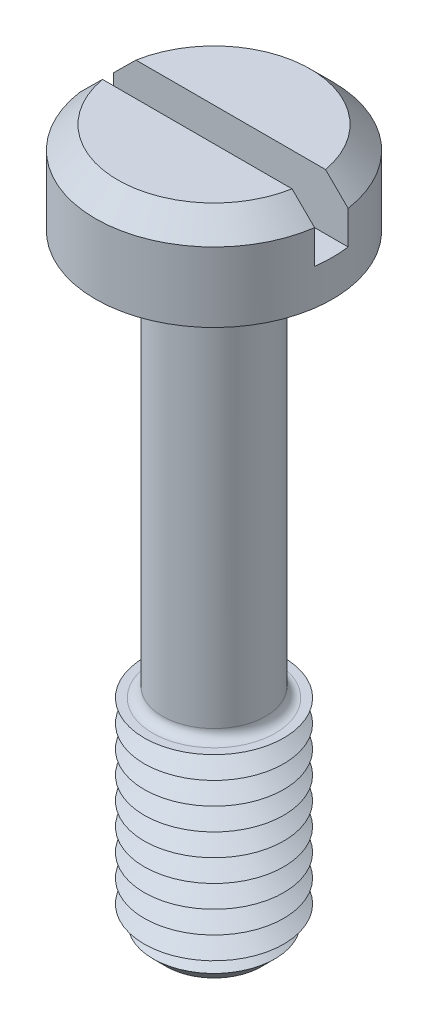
ISO-10303-21;
HEADER;
FILE_DESCRIPTION(('STEP AP214'),'2;1');
FILE_NAME('part.step','',(''),(''),'','','');
FILE_SCHEMA(('AUTOMOTIVE_DESIGN { 1 0 10303 214 1 1 1 1 }'));
ENDSEC;
DATA;
#1=APPLICATION_CONTEXT('core data for automotive mechanical design processes');
#2=APPLICATION_PROTOCOL_DEFINITION('international standard','automotive_design',2000,#1);
#3=PRODUCT_CONTEXT('',#1,'mechanical');
#4=PRODUCT('Part','Part','',(#3));
#5=PRODUCT_RELATED_PRODUCT_CATEGORY('part','',(#4));
#6=PRODUCT_DEFINITION_FORMATION('','',#4);
#7=PRODUCT_DEFINITION_CONTEXT('part definition',#1,'design');
#8=PRODUCT_DEFINITION('design','',#6,#7);
#9=PRODUCT_DEFINITION_SHAPE('','',#8);
#10=(LENGTH_UNIT() NAMED_UNIT(*) SI_UNIT(.MILLI.,.METRE.));
#11=(NAMED_UNIT(*) PLANE_ANGLE_UNIT() SI_UNIT($,.RADIAN.));
#12=(NAMED_UNIT(*) SI_UNIT($,.STERADIAN.) SOLID_ANGLE_UNIT());
#13=UNCERTAINTY_MEASURE_WITH_UNIT(LENGTH_MEASURE(1.E-05),#10,'distance_accuracy_value','');
#14=(GEOMETRIC_REPRESENTATION_CONTEXT(3) GLOBAL_UNCERTAINTY_ASSIGNED_CONTEXT((#13)) GLOBAL_UNIT_ASSIGNED_CONTEXT((#10,
#11,#12)) REPRESENTATION_CONTEXT('',''));
#15=CARTESIAN_POINT('',(0.,0.,0.));
#16=DIRECTION('',(0.,0.,1.));
#17=DIRECTION('',(1.,0.,0.));
#18=AXIS2_PLACEMENT_3D('',#15,#16,#17);
#19=CARTESIAN_POINT('',(0.,3.3,0.));
#20=DIRECTION('',(0.,1.,0.));
#21=DIRECTION('',(0.,0.,1.));
#22=AXIS2_PLACEMENT_3D('',#19,#20,#21);
#23=PLANE('',#22);
#24=DIRECTION('',(-1.,0.,0.));
#25=VECTOR('',#24,1.);
#26=CARTESIAN_POINT('',(4.25,3.3,-0.6));
#27=LINE('',#26,#25);
#28=CARTESIAN_POINT('',(3.39742549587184,3.3,-0.6));
#29=VERTEX_POINT('',#28);
#30=CARTESIAN_POINT('',(-3.39742549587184,3.3,-0.6));
#31=VERTEX_POINT('',#30);
#32=EDGE_CURVE('E110',#29,#31,#27,.T.);
#33=ORIENTED_EDGE('',*,*,#32,.F.);
#34=CARTESIAN_POINT('',(0.,3.3,0.));
#35=DIRECTION('',(0.,1.,0.));
#36=DIRECTION('',(0.,0.,1.));
#37=AXIS2_PLACEMENT_3D('',#34,#35,#36);
#38=CIRCLE('',#37,3.45);
#39=EDGE_CURVE('E113',#29,#31,#38,.T.);
#40=ORIENTED_EDGE('',*,*,#39,.T.);
#41=EDGE_LOOP('',(#33,#40));
#42=FACE_BOUND('',#41,.T.);
#43=ADVANCED_FACE('F39',(#42),#23,.T.);
#44=CARTESIAN_POINT('',(0.,3.3,0.));
#45=DIRECTION('',(0.,-1.,0.));
#46=DIRECTION('',(0.,0.,-1.));
#47=AXIS2_PLACEMENT_3D('',#44,#45,#46);
#48=CONICAL_SURFACE('',#47,3.45,0.785398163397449);
#49=CARTESIAN_POINT('',(9.35351408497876,-2.62273843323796,-0.6));
#50=CARTESIAN_POINT('',(9.03263557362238,-2.30252317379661,-0.6));
#51=CARTESIAN_POINT('',(8.7117281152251,-1.98233690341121,-0.6));
#52=CARTESIAN_POINT('',(8.069812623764,-1.34205341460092,-0.6));
#53=CARTESIAN_POINT('',(7.74880458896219,-1.02195619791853,-0.6));
#54=CARTESIAN_POINT('',(7.10652460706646,-0.381761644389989,-0.6));
#55=CARTESIAN_POINT('',(6.78525260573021,-0.0616643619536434,-0.6));
#56=CARTESIAN_POINT('',(6.14251393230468,0.578323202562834,-0.6));
#57=CARTESIAN_POINT('',(5.82104726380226,0.898213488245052,-0.6));
#58=CARTESIAN_POINT('',(5.17196209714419,1.5434750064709,-0.6));
#59=CARTESIAN_POINT('',(4.84433778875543,1.86884039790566,-0.6));
#60=CARTESIAN_POINT('',(4.35244442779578,2.35644593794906,-0.6));
#61=CARTESIAN_POINT('',(4.18839924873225,2.51891187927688,-0.6));
#62=CARTESIAN_POINT('',(3.86009606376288,2.84362679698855,-0.6));
#63=CARTESIAN_POINT('',(3.69583805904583,3.0058757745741,-0.6));
#64=CARTESIAN_POINT('',(3.36705354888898,3.33001661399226,-0.6));
#65=CARTESIAN_POINT('',(3.20252712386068,3.49190855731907,-0.6));
#66=CARTESIAN_POINT('',(2.87298689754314,3.81520272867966,-0.6));
#67=CARTESIAN_POINT('',(2.70797308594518,3.97660494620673,-0.6));
#68=CARTESIAN_POINT('',(2.37716903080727,4.29858210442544,-0.6));
#69=CARTESIAN_POINT('',(2.2113788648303,4.45915712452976,-0.6));
#70=CARTESIAN_POINT('',(1.96157219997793,4.69884609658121,-0.6));
#71=CARTESIAN_POINT('',(1.87811785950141,4.77854546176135,-0.6));
#72=CARTESIAN_POINT('',(1.71066064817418,4.93736532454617,-0.6));
#73=CARTESIAN_POINT('',(1.62665778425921,5.01648582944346,-0.6));
#74=CARTESIAN_POINT('',(1.49655488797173,5.13773269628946,-0.6));
#75=CARTESIAN_POINT('',(1.45074972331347,5.1801752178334,-0.6));
#76=CARTESIAN_POINT('',(1.35882119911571,5.26471614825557,-0.6));
#77=CARTESIAN_POINT('',(1.31269783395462,5.30681455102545,-0.6));
#78=CARTESIAN_POINT('',(1.22008852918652,5.39050695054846,-0.6));
#79=CARTESIAN_POINT('',(1.17360305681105,5.43210146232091,-0.6));
#80=CARTESIAN_POINT('',(1.08007401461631,5.51465347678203,-0.6));
#81=CARTESIAN_POINT('',(1.03303046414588,5.55561100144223,-0.6));
#82=CARTESIAN_POINT('',(0.919047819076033,5.65299331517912,-0.6));
#83=CARTESIAN_POINT('',(0.851738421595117,5.70899242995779,-0.6));
#84=CARTESIAN_POINT('',(0.748806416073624,5.79068526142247,-0.6));
#85=CARTESIAN_POINT('',(0.714125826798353,5.81756213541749,-0.6));
#86=CARTESIAN_POINT('',(0.643915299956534,5.8701807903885,-0.6));
#87=CARTESIAN_POINT('',(0.608385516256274,5.89592277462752,-0.6));
#88=CARTESIAN_POINT('',(0.545162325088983,5.93955652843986,-0.6));
#89=CARTESIAN_POINT('',(0.517718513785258,5.95780799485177,-0.6));
#90=CARTESIAN_POINT('',(0.462025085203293,5.99303174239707,-0.6));
#91=CARTESIAN_POINT('',(0.433775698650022,6.01000438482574,-0.6));
#92=CARTESIAN_POINT('',(0.376341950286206,6.04213837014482,-0.6));
#93=CARTESIAN_POINT('',(0.34716009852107,6.05730412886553,-0.6));
#94=CARTESIAN_POINT('',(0.2876425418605,6.08513394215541,-0.6));
#95=CARTESIAN_POINT('',(0.257308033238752,6.09780051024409,-0.6));
#96=CARTESIAN_POINT('',(0.190863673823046,6.12124627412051,-0.6));
#97=CARTESIAN_POINT('',(0.154554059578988,6.1314857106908,-0.6));
#98=CARTESIAN_POINT('',(0.0807909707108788,6.1456540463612,-0.6));
#99=CARTESIAN_POINT('',(0.0433423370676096,6.14960664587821,-0.6));
#100=CARTESIAN_POINT('',(-0.0317987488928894,6.15033783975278,-0.6));
#101=CARTESIAN_POINT('',(-0.0694915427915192,6.1470842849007,-0.6));
#102=CARTESIAN_POINT('',(-0.143790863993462,6.13410921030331,-0.6));
#103=CARTESIAN_POINT('',(-0.180393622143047,6.12436747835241,-0.6));
#104=CARTESIAN_POINT('',(-0.254098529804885,6.09939647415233,-0.6));
#105=CARTESIAN_POINT('',(-0.291094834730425,6.0838685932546,-0.6));
#106=CARTESIAN_POINT('',(-0.363408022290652,6.0492466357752,-0.6));
#107=CARTESIAN_POINT('',(-0.398721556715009,6.03014579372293,-0.6));
#108=CARTESIAN_POINT('',(-0.468234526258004,5.98944452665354,-0.6));
#109=CARTESIAN_POINT('',(-0.50242270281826,5.96782521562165,-0.6));
#110=CARTESIAN_POINT('',(-0.569689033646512,5.92300618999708,-0.6));
#111=CARTESIAN_POINT('',(-0.602768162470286,5.89980792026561,-0.6));
#112=CARTESIAN_POINT('',(-0.671148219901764,5.85008963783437,-0.6));
#113=CARTESIAN_POINT('',(-0.706369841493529,5.82346130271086,-0.6));
#114=CARTESIAN_POINT('',(-0.776087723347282,5.76926828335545,-0.6));
#115=CARTESIAN_POINT('',(-0.810583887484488,5.74170347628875,-0.6));
#116=CARTESIAN_POINT('',(-0.913286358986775,5.6579827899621,-0.6));
#117=CARTESIAN_POINT('',(-0.980673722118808,5.60082541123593,-0.6));
#118=CARTESIAN_POINT('',(-1.11424616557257,5.48490670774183,-0.6));
#119=CARTESIAN_POINT('',(-1.18042891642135,5.42614273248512,-0.6));
#120=CARTESIAN_POINT('',(-1.31191262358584,5.30767463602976,-0.6));
#121=CARTESIAN_POINT('',(-1.37721382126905,5.24797078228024,-0.6));
#122=CARTESIAN_POINT('',(-1.50701089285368,5.12812906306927,-0.6));
#123=CARTESIAN_POINT('',(-1.57150872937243,5.06799331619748,-0.6));
#124=CARTESIAN_POINT('',(-1.70009132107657,4.94727328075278,-0.6));
#125=CARTESIAN_POINT('',(-1.76417604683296,4.88668896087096,-0.6));
#126=CARTESIAN_POINT('',(-1.95584105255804,4.7045882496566,-0.6));
#127=CARTESIAN_POINT('',(-2.08296922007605,4.58259645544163,-0.6));
#128=CARTESIAN_POINT('',(-2.33599178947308,4.33840625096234,-0.6));
#129=CARTESIAN_POINT('',(-2.46188913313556,4.21621087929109,-0.6));
#130=CARTESIAN_POINT('',(-2.71323511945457,3.9713592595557,-0.6));
#131=CARTESIAN_POINT('',(-2.83868376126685,3.84870301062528,-0.6));
#132=CARTESIAN_POINT('',(-3.21459106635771,3.48027743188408,-0.6));
#133=CARTESIAN_POINT('',(-3.46460626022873,3.23405597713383,-0.6));
#134=CARTESIAN_POINT('',(-3.96413793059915,2.74090313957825,-0.6));
#135=CARTESIAN_POINT('',(-4.21365415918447,2.49397150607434,-0.6));
#136=CARTESIAN_POINT('',(-4.71232475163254,1.99974737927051,-0.6));
#137=CARTESIAN_POINT('',(-4.96147911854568,1.75245488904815,-0.6));
#138=CARTESIAN_POINT('',(-5.45958725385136,1.25761544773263,-0.6));
#139=CARTESIAN_POINT('',(-5.70854099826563,1.01006847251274,-0.6));
#140=CARTESIAN_POINT('',(-6.20629498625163,0.514819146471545,-0.6));
#141=CARTESIAN_POINT('',(-6.45509522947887,0.267116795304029,-0.6));
#142=CARTESIAN_POINT('',(-7.2012856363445,-0.47610004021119,-0.6));
#143=CARTESIAN_POINT('',(-7.6985162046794,-0.971774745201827,-0.6));
#144=CARTESIAN_POINT('',(-8.38865115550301,-1.66007026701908,-0.6));
#145=CARTESIAN_POINT('',(-8.58165346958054,-1.85259293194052,-0.6));
#146=CARTESIAN_POINT('',(-8.8711273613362,-2.14139225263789,-0.6));
#147=CARTESIAN_POINT('',(-8.96761014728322,-2.23765767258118,-0.6));
#148=CARTESIAN_POINT('',(-9.16056764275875,-2.43019387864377,-0.6));
#149=CARTESIAN_POINT('',(-9.25704235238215,-2.52646466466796,-0.6));
#150=CARTESIAN_POINT('',(-9.35351408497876,-2.62273843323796,-0.6));
#151=B_SPLINE_CURVE_WITH_KNOTS('',3,(#49,#50,#51,#52,#53,#54,#55,#56,#57,#58,#59,#60,#61,#62,
#63,#64,#65,#66,#67,#68,#69,#70,#71,#72,#73,#74,#75,#76,#77,#78,#79,#80,#81,#82,#83,#84,#85,#86,
#87,#88,#89,#90,#91,#92,#93,#94,#95,#96,#97,#98,#99,#100,#101,#102,#103,#104,#105,#106,#107,
#108,#109,#110,#111,#112,#113,#114,#115,#116,#117,#118,#119,#120,#121,#122,#123,#124,#125,#126,
#127,#128,#129,#130,#131,#132,#133,#134,#135,#136,#137,#138,#139,#140,#141,#142,#143,#144,#145,
#146,#147,#148,#149,#150),.UNSPECIFIED.,.F.,.F.,(4,2,2,2,2,2,2,2,2,2,2,2,2,2,2,2,2,2,2,2,2,2,2,
2,2,2,2,2,2,2,2,2,2,2,2,2,2,2,2,2,2,2,2,2,2,2,2,2,2,2,4),(0.,1.35996600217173,2.71995696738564,
4.08050889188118,5.44103646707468,6.82624457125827,7.51888721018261,8.21152599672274,
8.90398568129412,9.59646011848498,10.288866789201,10.6350581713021,10.9812451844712,
11.1685812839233,11.3559207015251,11.5430489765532,11.7301707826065,11.9927784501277,
12.1243921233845,12.2559821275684,12.3548333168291,12.4536564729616,12.5522329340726,
12.6507097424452,12.763461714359,12.8757876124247,12.9886156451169,13.101796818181,
13.2218851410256,13.3422031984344,13.4634899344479,13.584667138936,13.7171086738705,
13.8495676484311,14.1146090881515,14.3801178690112,14.6455524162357,14.910099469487,
15.17466516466,15.7032346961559,16.2295761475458,16.755918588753,17.808623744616,
18.8617626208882,19.9148925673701,20.9681337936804,22.0213773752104,24.1276499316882,
24.9454725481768,25.3543534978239,25.7632286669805),.UNSPECIFIED.);
#152=CARTESIAN_POINT('',(4.20743389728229,2.5,-0.6));
#153=VERTEX_POINT('',#152);
#154=EDGE_CURVE('E268',#153,#29,#151,.T.);
#155=ORIENTED_EDGE('',*,*,#154,.F.);
#156=CARTESIAN_POINT('',(0.,2.5,0.));
#157=DIRECTION('',(0.,1.,0.));
#158=DIRECTION('',(0.,0.,1.));
#159=AXIS2_PLACEMENT_3D('',#156,#157,#158);
#160=CIRCLE('',#159,4.25);
#161=CARTESIAN_POINT('',(-4.20743389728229,2.5,-0.6));
#162=VERTEX_POINT('',#161);
#163=EDGE_CURVE('E128',#162,#153,#160,.F.);
#164=ORIENTED_EDGE('',*,*,#163,.F.);
#165=EDGE_CURVE('E102',#31,#162,#151,.T.);
#166=ORIENTED_EDGE('',*,*,#165,.F.);
#167=ORIENTED_EDGE('',*,*,#39,.F.);
#168=EDGE_LOOP('',(#155,#164,#166,#167));
#169=FACE_BOUND('',#168,.T.);
#170=ADVANCED_FACE('F230',(#169),#48,.T.);
#171=CARTESIAN_POINT('',(0.,-22.,0.));
#172=DIRECTION('',(0.,1.,0.));
#173=DIRECTION('',(0.,0.,1.));
#174=AXIS2_PLACEMENT_3D('',#171,#172,#173);
#175=CYLINDRICAL_SURFACE('',#174,1.85);
#176=CARTESIAN_POINT('',(0.,-14.15,0.));
#177=DIRECTION('',(0.,-1.,0.));
#178=DIRECTION('',(0.,0.,-1.));
#179=AXIS2_PLACEMENT_3D('',#176,#177,#178);
#180=CIRCLE('',#179,1.85);
#181=CARTESIAN_POINT('',(0.,-14.15,-1.85));
#182=VERTEX_POINT('',#181);
#183=EDGE_CURVE('E123',#182,#182,#180,.F.);
#184=ORIENTED_EDGE('',*,*,#183,.T.);
#185=EDGE_LOOP('',(#184));
#186=FACE_BOUND('',#185,.T.);
#187=CARTESIAN_POINT('',(0.,-0.35,0.));
#188=DIRECTION('',(0.,1.,0.));
#189=DIRECTION('',(0.,0.,1.));
#190=AXIS2_PLACEMENT_3D('',#187,#188,#189);
#191=CIRCLE('',#190,1.85);
#192=CARTESIAN_POINT('',(0.,-0.35,1.85));
#193=VERTEX_POINT('',#192);
#194=EDGE_CURVE('E384',#193,#193,#191,.F.);
#195=ORIENTED_EDGE('',*,*,#194,.T.);
#196=EDGE_LOOP('',(#195));
#197=FACE_BOUND('',#196,.T.);
#198=ADVANCED_FACE('F226',(#186,#197),#175,.T.);
#199=CARTESIAN_POINT('',(0.,3.3,0.));
#200=DIRECTION('',(0.,-1.,0.));
#201=DIRECTION('',(0.,0.,-1.));
#202=AXIS2_PLACEMENT_3D('',#199,#200,#201);
#203=CYLINDRICAL_SURFACE('',#202,4.25);
#204=ORIENTED_EDGE('',*,*,#163,.T.);
#205=DIRECTION('',(0.,-1.,0.));
#206=VECTOR('',#205,1.);
#207=CARTESIAN_POINT('',(4.20743389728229,3.3,-0.6));
#208=LINE('',#207,#206);
#209=CARTESIAN_POINT('',(4.20743389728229,1.3,-0.6));
#210=VERTEX_POINT('',#209);
#211=EDGE_CURVE('E64',#153,#210,#208,.T.);
#212=ORIENTED_EDGE('',*,*,#211,.T.);
#213=CARTESIAN_POINT('',(0.,1.3,0.));
#214=DIRECTION('',(0.,1.,0.));
#215=DIRECTION('',(0.,0.,1.));
#216=AXIS2_PLACEMENT_3D('',#213,#214,#215);
#217=CIRCLE('',#216,4.25);
#218=CARTESIAN_POINT('',(4.20743389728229,1.3,0.6));
#219=VERTEX_POINT('',#218);
#220=EDGE_CURVE('E11',#219,#210,#217,.T.);
#221=ORIENTED_EDGE('',*,*,#220,.F.);
#222=DIRECTION('',(0.,-1.,0.));
#223=VECTOR('',#222,1.);
#224=CARTESIAN_POINT('',(4.20743389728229,3.3,0.6));
#225=LINE('',#224,#223);
#226=CARTESIAN_POINT('',(4.20743389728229,2.5,0.6));
#227=VERTEX_POINT('',#226);
#228=EDGE_CURVE('E287',#219,#227,#225,.F.);
#229=ORIENTED_EDGE('',*,*,#228,.T.);
#230=CARTESIAN_POINT('',(-4.20743389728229,2.5,0.6));
#231=VERTEX_POINT('',#230);
#232=EDGE_CURVE('E120',#227,#231,#160,.F.);
#233=ORIENTED_EDGE('',*,*,#232,.T.);
#234=DIRECTION('',(0.,-1.,0.));
#235=VECTOR('',#234,1.);
#236=CARTESIAN_POINT('',(-4.20743389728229,3.3,0.6));
#237=LINE('',#236,#235);
#238=CARTESIAN_POINT('',(-4.20743389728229,1.3,0.6));
#239=VERTEX_POINT('',#238);
#240=EDGE_CURVE('E96',#231,#239,#237,.T.);
#241=ORIENTED_EDGE('',*,*,#240,.T.);
#242=CARTESIAN_POINT('',(-4.20743389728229,1.3,-0.6));
#243=VERTEX_POINT('',#242);
#244=EDGE_CURVE('E44',#243,#239,#217,.T.);
#245=ORIENTED_EDGE('',*,*,#244,.F.);
#246=DIRECTION('',(0.,-1.,0.));
#247=VECTOR('',#246,1.);
#248=CARTESIAN_POINT('',(-4.20743389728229,3.3,-0.6));
#249=LINE('',#248,#247);
#250=EDGE_CURVE('E292',#243,#162,#249,.F.);
#251=ORIENTED_EDGE('',*,*,#250,.T.);
#252=EDGE_LOOP('',(#204,#212,#221,#229,#233,#241,#245,#251));
#253=FACE_BOUND('',#252,.T.);
#254=CARTESIAN_POINT('',(0.,0.,0.));
#255=DIRECTION('',(0.,1.,0.));
#256=DIRECTION('',(0.,0.,1.));
#257=AXIS2_PLACEMENT_3D('',#254,#255,#256);
#258=CIRCLE('',#257,4.25);
#259=CARTESIAN_POINT('',(0.,0.,4.25));
#260=VERTEX_POINT('',#259);
#261=EDGE_CURVE('E371',#260,#260,#258,.T.);
#262=ORIENTED_EDGE('',*,*,#261,.T.);
#263=EDGE_LOOP('',(#262));
#264=FACE_BOUND('',#263,.T.);
#265=ADVANCED_FACE('F229',(#253,#264),#203,.T.);
#266=DIRECTION('',(1.,0.,0.));
#267=VECTOR('',#266,1.);
#268=CARTESIAN_POINT('',(4.25,3.3,0.6));
#269=LINE('',#268,#267);
#270=CARTESIAN_POINT('',(-3.39742549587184,3.3,0.6));
#271=VERTEX_POINT('',#270);
#272=CARTESIAN_POINT('',(3.39742549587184,3.3,0.6));
#273=VERTEX_POINT('',#272);
#274=EDGE_CURVE('E56',#271,#273,#269,.T.);
#275=ORIENTED_EDGE('',*,*,#274,.F.);
#276=EDGE_CURVE('E108',#271,#273,#38,.T.);
#277=ORIENTED_EDGE('',*,*,#276,.T.);
#278=EDGE_LOOP('',(#275,#277));
#279=FACE_BOUND('',#278,.T.);
#280=ADVANCED_FACE('F107',(#279),#23,.T.);
#281=CARTESIAN_POINT('',(0.,0.,0.));
#282=DIRECTION('',(0.,1.,0.));
#283=DIRECTION('',(0.,0.,1.));
#284=AXIS2_PLACEMENT_3D('',#281,#282,#283);
#285=PLANE('',#284);
#286=CARTESIAN_POINT('',(0.,0.,0.));
#287=DIRECTION('',(0.,1.,0.));
#288=DIRECTION('',(0.,0.,1.));
#289=AXIS2_PLACEMENT_3D('',#286,#287,#288);
#290=CIRCLE('',#289,2.2);
#291=CARTESIAN_POINT('',(0.,0.,2.2));
#292=VERTEX_POINT('',#291);
#293=EDGE_CURVE('E114',#292,#292,#290,.T.);
#294=ORIENTED_EDGE('',*,*,#293,.T.);
#295=EDGE_LOOP('',(#294));
#296=FACE_BOUND('',#295,.T.);
#297=ORIENTED_EDGE('',*,*,#261,.F.);
#298=EDGE_LOOP('',(#297));
#299=FACE_BOUND('',#298,.T.);
#300=ADVANCED_FACE('F220',(#296,#299),#285,.F.);
#301=CARTESIAN_POINT('',(0.,-14.5,0.));
#302=DIRECTION('',(0.,-1.,0.));
#303=DIRECTION('',(0.,0.,-1.));
#304=AXIS2_PLACEMENT_3D('',#301,#302,#303);
#305=PLANE('',#304);
#306=CARTESIAN_POINT('',(0.,-14.5,0.));
#307=DIRECTION('',(0.,-1.,0.));
#308=DIRECTION('',(0.,0.,-1.));
#309=AXIS2_PLACEMENT_3D('',#306,#307,#308);
#310=CIRCLE('',#309,2.2);
#311=CARTESIAN_POINT('',(0.,-14.5,-2.2));
#312=VERTEX_POINT('',#311);
#313=EDGE_CURVE('E378',#312,#312,#310,.T.);
#314=ORIENTED_EDGE('',*,*,#313,.T.);
#315=EDGE_LOOP('',(#314));
#316=FACE_BOUND('',#315,.T.);
#317=CARTESIAN_POINT('',(0.,-14.5,0.));
#318=DIRECTION('',(0.,1.,0.));
#319=DIRECTION('',(0.,0.,1.));
#320=AXIS2_PLACEMENT_3D('',#317,#318,#319);
#321=CIRCLE('',#320,2.5);
#322=CARTESIAN_POINT('',(0.,-14.5,2.5));
#323=VERTEX_POINT('',#322);
#324=EDGE_CURVE('E367',#323,#323,#321,.T.);
#325=ORIENTED_EDGE('',*,*,#324,.T.);
#326=EDGE_LOOP('',(#325));
#327=FACE_BOUND('',#326,.T.);
#328=ADVANCED_FACE('F216',(#316,#327),#305,.F.);
#329=CARTESIAN_POINT('',(0.,-14.9,0.));
#330=DIRECTION('',(0.,1.,0.));
#331=DIRECTION('',(0.,0.,1.));
#332=AXIS2_PLACEMENT_3D('',#329,#330,#331);
#333=CONICAL_SURFACE('',#332,1.80717967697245,1.0471975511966);
#334=ORIENTED_EDGE('',*,*,#324,.F.);
#335=EDGE_LOOP('',(#334));
#336=FACE_BOUND('',#335,.T.);
#337=CARTESIAN_POINT('',(0.,-14.9,0.));
#338=DIRECTION('',(0.,1.,0.));
#339=DIRECTION('',(0.,0.,1.));
#340=AXIS2_PLACEMENT_3D('',#337,#338,#339);
#341=CIRCLE('',#340,1.80717967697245);
#342=CARTESIAN_POINT('',(0.,-14.9,1.80717967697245));
#343=VERTEX_POINT('',#342);
#344=EDGE_CURVE('E363',#343,#343,#341,.T.);
#345=ORIENTED_EDGE('',*,*,#344,.T.);
#346=EDGE_LOOP('',(#345));
#347=FACE_BOUND('',#346,.T.);
#348=ADVANCED_FACE('F212',(#336,#347),#333,.T.);
#349=CARTESIAN_POINT('',(0.,-15.3,0.));
#350=DIRECTION('',(0.,-1.,0.));
#351=DIRECTION('',(0.,0.,-1.));
#352=AXIS2_PLACEMENT_3D('',#349,#350,#351);
#353=CONICAL_SURFACE('',#352,2.5,1.0471975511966);
#354=ORIENTED_EDGE('',*,*,#344,.F.);
#355=EDGE_LOOP('',(#354));
#356=FACE_BOUND('',#355,.T.);
#357=CARTESIAN_POINT('',(0.,-15.3,0.));
#358=DIRECTION('',(0.,1.,0.));
#359=DIRECTION('',(0.,0.,1.));
#360=AXIS2_PLACEMENT_3D('',#357,#358,#359);
#361=CIRCLE('',#360,2.5);
#362=CARTESIAN_POINT('',(0.,-15.3,2.5));
#363=VERTEX_POINT('',#362);
#364=EDGE_CURVE('E360',#363,#363,#361,.T.);
#365=ORIENTED_EDGE('',*,*,#364,.T.);
#366=EDGE_LOOP('',(#365));
#367=FACE_BOUND('',#366,.T.);
#368=ADVANCED_FACE('F208',(#356,#367),#353,.T.);
#369=CARTESIAN_POINT('',(0.,-15.7,0.));
#370=DIRECTION('',(0.,1.,0.));
#371=DIRECTION('',(0.,0.,1.));
#372=AXIS2_PLACEMENT_3D('',#369,#370,#371);
#373=CONICAL_SURFACE('',#372,1.80717967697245,1.0471975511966);
#374=ORIENTED_EDGE('',*,*,#364,.F.);
#375=EDGE_LOOP('',(#374));
#376=FACE_BOUND('',#375,.T.);
#377=CARTESIAN_POINT('',(0.,-15.7,0.));
#378=DIRECTION('',(0.,1.,0.));
#379=DIRECTION('',(0.,0.,1.));
#380=AXIS2_PLACEMENT_3D('',#377,#378,#379);
#381=CIRCLE('',#380,1.80717967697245);
#382=CARTESIAN_POINT('',(0.,-15.7,1.80717967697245));
#383=VERTEX_POINT('',#382);
#384=EDGE_CURVE('E356',#383,#383,#381,.T.);
#385=ORIENTED_EDGE('',*,*,#384,.T.);
#386=EDGE_LOOP('',(#385));
#387=FACE_BOUND('',#386,.T.);
#388=ADVANCED_FACE('F204',(#376,#387),#373,.T.);
#389=CARTESIAN_POINT('',(0.,-16.1,0.));
#390=DIRECTION('',(0.,-1.,0.));
#391=DIRECTION('',(0.,0.,-1.));
#392=AXIS2_PLACEMENT_3D('',#389,#390,#391);
#393=CONICAL_SURFACE('',#392,2.5,1.0471975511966);
#394=ORIENTED_EDGE('',*,*,#384,.F.);
#395=EDGE_LOOP('',(#394));
#396=FACE_BOUND('',#395,.T.);
#397=CARTESIAN_POINT('',(0.,-16.1,0.));
#398=DIRECTION('',(0.,1.,0.));
#399=DIRECTION('',(0.,0.,1.));
#400=AXIS2_PLACEMENT_3D('',#397,#398,#399);
#401=CIRCLE('',#400,2.5);
#402=CARTESIAN_POINT('',(0.,-16.1,2.5));
#403=VERTEX_POINT('',#402);
#404=EDGE_CURVE('E352',#403,#403,#401,.T.);
#405=ORIENTED_EDGE('',*,*,#404,.T.);
#406=EDGE_LOOP('',(#405));
#407=FACE_BOUND('',#406,.T.);
#408=ADVANCED_FACE('F200',(#396,#407),#393,.T.);
#409=CARTESIAN_POINT('',(0.,-16.5,0.));
#410=DIRECTION('',(0.,1.,0.));
#411=DIRECTION('',(0.,0.,1.));
#412=AXIS2_PLACEMENT_3D('',#409,#410,#411);
#413=CONICAL_SURFACE('',#412,1.80717967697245,1.0471975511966);
#414=ORIENTED_EDGE('',*,*,#404,.F.);
#415=EDGE_LOOP('',(#414));
#416=FACE_BOUND('',#415,.T.);
#417=CARTESIAN_POINT('',(0.,-16.5,0.));
#418=DIRECTION('',(0.,1.,0.));
#419=DIRECTION('',(0.,0.,1.));
#420=AXIS2_PLACEMENT_3D('',#417,#418,#419);
#421=CIRCLE('',#420,1.80717967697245);
#422=CARTESIAN_POINT('',(0.,-16.5,1.80717967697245));
#423=VERTEX_POINT('',#422);
#424=EDGE_CURVE('E348',#423,#423,#421,.T.);
#425=ORIENTED_EDGE('',*,*,#424,.T.);
#426=EDGE_LOOP('',(#425));
#427=FACE_BOUND('',#426,.T.);
#428=ADVANCED_FACE('F196',(#416,#427),#413,.T.);
#429=CARTESIAN_POINT('',(0.,-16.9,0.));
#430=DIRECTION('',(0.,-1.,0.));
#431=DIRECTION('',(0.,0.,-1.));
#432=AXIS2_PLACEMENT_3D('',#429,#430,#431);
#433=CONICAL_SURFACE('',#432,2.5,1.0471975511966);
#434=ORIENTED_EDGE('',*,*,#424,.F.);
#435=EDGE_LOOP('',(#434));
#436=FACE_BOUND('',#435,.T.);
#437=CARTESIAN_POINT('',(0.,-16.9,0.));
#438=DIRECTION('',(0.,1.,0.));
#439=DIRECTION('',(0.,0.,1.));
#440=AXIS2_PLACEMENT_3D('',#437,#438,#439);
#441=CIRCLE('',#440,2.5);
#442=CARTESIAN_POINT('',(0.,-16.9,2.5));
#443=VERTEX_POINT('',#442);
#444=EDGE_CURVE('E344',#443,#443,#441,.T.);
#445=ORIENTED_EDGE('',*,*,#444,.T.);
#446=EDGE_LOOP('',(#445));
#447=FACE_BOUND('',#446,.T.);
#448=ADVANCED_FACE('F192',(#436,#447),#433,.T.);
#449=CARTESIAN_POINT('',(0.,-17.3,0.));
#450=DIRECTION('',(0.,1.,0.));
#451=DIRECTION('',(0.,0.,1.));
#452=AXIS2_PLACEMENT_3D('',#449,#450,#451);
#453=CONICAL_SURFACE('',#452,1.80717967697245,1.0471975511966);
#454=ORIENTED_EDGE('',*,*,#444,.F.);
#455=EDGE_LOOP('',(#454));
#456=FACE_BOUND('',#455,.T.);
#457=CARTESIAN_POINT('',(0.,-17.3,0.));
#458=DIRECTION('',(0.,1.,0.));
#459=DIRECTION('',(0.,0.,1.));
#460=AXIS2_PLACEMENT_3D('',#457,#458,#459);
#461=CIRCLE('',#460,1.80717967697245);
#462=CARTESIAN_POINT('',(0.,-17.3,1.80717967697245));
#463=VERTEX_POINT('',#462);
#464=EDGE_CURVE('E340',#463,#463,#461,.T.);
#465=ORIENTED_EDGE('',*,*,#464,.T.);
#466=EDGE_LOOP('',(#465));
#467=FACE_BOUND('',#466,.T.);
#468=ADVANCED_FACE('F188',(#456,#467),#453,.T.);
#469=CARTESIAN_POINT('',(0.,-17.7,0.));
#470=DIRECTION('',(0.,-1.,0.));
#471=DIRECTION('',(0.,0.,-1.));
#472=AXIS2_PLACEMENT_3D('',#469,#470,#471);
#473=CONICAL_SURFACE('',#472,2.5,1.0471975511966);
#474=ORIENTED_EDGE('',*,*,#464,.F.);
#475=EDGE_LOOP('',(#474));
#476=FACE_BOUND('',#475,.T.);
#477=CARTESIAN_POINT('',(0.,-17.7,0.));
#478=DIRECTION('',(0.,1.,0.));
#479=DIRECTION('',(0.,0.,1.));
#480=AXIS2_PLACEMENT_3D('',#477,#478,#479);
#481=CIRCLE('',#480,2.5);
#482=CARTESIAN_POINT('',(0.,-17.7,2.5));
#483=VERTEX_POINT('',#482);
#484=EDGE_CURVE('E337',#483,#483,#481,.T.);
#485=ORIENTED_EDGE('',*,*,#484,.T.);
#486=EDGE_LOOP('',(#485));
#487=FACE_BOUND('',#486,.T.);
#488=ADVANCED_FACE('F184',(#476,#487),#473,.T.);
#489=CARTESIAN_POINT('',(0.,-18.1,0.));
#490=DIRECTION('',(0.,1.,0.));
#491=DIRECTION('',(0.,0.,1.));
#492=AXIS2_PLACEMENT_3D('',#489,#490,#491);
#493=CONICAL_SURFACE('',#492,1.80717967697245,1.0471975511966);
#494=ORIENTED_EDGE('',*,*,#484,.F.);
#495=EDGE_LOOP('',(#494));
#496=FACE_BOUND('',#495,.T.);
#497=CARTESIAN_POINT('',(0.,-18.1,0.));
#498=DIRECTION('',(0.,1.,0.));
#499=DIRECTION('',(0.,0.,1.));
#500=AXIS2_PLACEMENT_3D('',#497,#498,#499);
#501=CIRCLE('',#500,1.80717967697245);
#502=CARTESIAN_POINT('',(0.,-18.1,1.80717967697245));
#503=VERTEX_POINT('',#502);
#504=EDGE_CURVE('E333',#503,#503,#501,.T.);
#505=ORIENTED_EDGE('',*,*,#504,.T.);
#506=EDGE_LOOP('',(#505));
#507=FACE_BOUND('',#506,.T.);
#508=ADVANCED_FACE('F180',(#496,#507),#493,.T.);
#509=CARTESIAN_POINT('',(0.,-18.5,0.));
#510=DIRECTION('',(0.,-1.,0.));
#511=DIRECTION('',(0.,0.,-1.));
#512=AXIS2_PLACEMENT_3D('',#509,#510,#511);
#513=CONICAL_SURFACE('',#512,2.5,1.0471975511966);
#514=ORIENTED_EDGE('',*,*,#504,.F.);
#515=EDGE_LOOP('',(#514));
#516=FACE_BOUND('',#515,.T.);
#517=CARTESIAN_POINT('',(0.,-18.5,0.));
#518=DIRECTION('',(0.,1.,0.));
#519=DIRECTION('',(0.,0.,1.));
#520=AXIS2_PLACEMENT_3D('',#517,#518,#519);
#521=CIRCLE('',#520,2.5);
#522=CARTESIAN_POINT('',(0.,-18.5,2.5));
#523=VERTEX_POINT('',#522);
#524=EDGE_CURVE('E330',#523,#523,#521,.T.);
#525=ORIENTED_EDGE('',*,*,#524,.T.);
#526=EDGE_LOOP('',(#525));
#527=FACE_BOUND('',#526,.T.);
#528=ADVANCED_FACE('F176',(#516,#527),#513,.T.);
#529=CARTESIAN_POINT('',(0.,-18.9,0.));
#530=DIRECTION('',(0.,1.,0.));
#531=DIRECTION('',(0.,0.,1.));
#532=AXIS2_PLACEMENT_3D('',#529,#530,#531);
#533=CONICAL_SURFACE('',#532,1.80717967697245,1.0471975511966);
#534=ORIENTED_EDGE('',*,*,#524,.F.);
#535=EDGE_LOOP('',(#534));
#536=FACE_BOUND('',#535,.T.);
#537=CARTESIAN_POINT('',(0.,-18.9,0.));
#538=DIRECTION('',(0.,1.,0.));
#539=DIRECTION('',(0.,0.,1.));
#540=AXIS2_PLACEMENT_3D('',#537,#538,#539);
#541=CIRCLE('',#540,1.80717967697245);
#542=CARTESIAN_POINT('',(0.,-18.9,1.80717967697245));
#543=VERTEX_POINT('',#542);
#544=EDGE_CURVE('E327',#543,#543,#541,.T.);
#545=ORIENTED_EDGE('',*,*,#544,.T.);
#546=EDGE_LOOP('',(#545));
#547=FACE_BOUND('',#546,.T.);
#548=ADVANCED_FACE('F172',(#536,#547),#533,.T.);
#549=CARTESIAN_POINT('',(0.,-19.3,0.));
#550=DIRECTION('',(0.,-1.,0.));
#551=DIRECTION('',(0.,0.,-1.));
#552=AXIS2_PLACEMENT_3D('',#549,#550,#551);
#553=CONICAL_SURFACE('',#552,2.5,1.0471975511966);
#554=ORIENTED_EDGE('',*,*,#544,.F.);
#555=EDGE_LOOP('',(#554));
#556=FACE_BOUND('',#555,.T.);
#557=CARTESIAN_POINT('',(0.,-19.3,0.));
#558=DIRECTION('',(0.,1.,0.));
#559=DIRECTION('',(0.,0.,1.));
#560=AXIS2_PLACEMENT_3D('',#557,#558,#559);
#561=CIRCLE('',#560,2.5);
#562=CARTESIAN_POINT('',(0.,-19.3,2.5));
#563=VERTEX_POINT('',#562);
#564=EDGE_CURVE('E324',#563,#563,#561,.T.);
#565=ORIENTED_EDGE('',*,*,#564,.T.);
#566=EDGE_LOOP('',(#565));
#567=FACE_BOUND('',#566,.T.);
#568=ADVANCED_FACE('F168',(#556,#567),#553,.T.);
#569=CARTESIAN_POINT('',(0.,-19.7,0.));
#570=DIRECTION('',(0.,1.,0.));
#571=DIRECTION('',(0.,0.,1.));
#572=AXIS2_PLACEMENT_3D('',#569,#570,#571);
#573=CONICAL_SURFACE('',#572,1.80717967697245,1.0471975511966);
#574=ORIENTED_EDGE('',*,*,#564,.F.);
#575=EDGE_LOOP('',(#574));
#576=FACE_BOUND('',#575,.T.);
#577=CARTESIAN_POINT('',(0.,-19.7,0.));
#578=DIRECTION('',(0.,1.,0.));
#579=DIRECTION('',(0.,0.,1.));
#580=AXIS2_PLACEMENT_3D('',#577,#578,#579);
#581=CIRCLE('',#580,1.80717967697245);
#582=CARTESIAN_POINT('',(0.,-19.7,1.80717967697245));
#583=VERTEX_POINT('',#582);
#584=EDGE_CURVE('E320',#583,#583,#581,.T.);
#585=ORIENTED_EDGE('',*,*,#584,.T.);
#586=EDGE_LOOP('',(#585));
#587=FACE_BOUND('',#586,.T.);
#588=ADVANCED_FACE('F164',(#576,#587),#573,.T.);
#589=CARTESIAN_POINT('',(0.,-20.1,0.));
#590=DIRECTION('',(0.,-1.,0.));
#591=DIRECTION('',(0.,0.,-1.));
#592=AXIS2_PLACEMENT_3D('',#589,#590,#591);
#593=CONICAL_SURFACE('',#592,2.5,1.0471975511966);
#594=ORIENTED_EDGE('',*,*,#584,.F.);
#595=EDGE_LOOP('',(#594));
#596=FACE_BOUND('',#595,.T.);
#597=CARTESIAN_POINT('',(0.,-20.1,0.));
#598=DIRECTION('',(0.,1.,0.));
#599=DIRECTION('',(0.,0.,1.));
#600=AXIS2_PLACEMENT_3D('',#597,#598,#599);
#601=CIRCLE('',#600,2.5);
#602=CARTESIAN_POINT('',(0.,-20.1,2.5));
#603=VERTEX_POINT('',#602);
#604=EDGE_CURVE('E316',#603,#603,#601,.T.);
#605=ORIENTED_EDGE('',*,*,#604,.T.);
#606=EDGE_LOOP('',(#605));
#607=FACE_BOUND('',#606,.T.);
#608=ADVANCED_FACE('F160',(#596,#607),#593,.T.);
#609=CARTESIAN_POINT('',(0.,-20.5,0.));
#610=DIRECTION('',(0.,1.,0.));
#611=DIRECTION('',(0.,0.,1.));
#612=AXIS2_PLACEMENT_3D('',#609,#610,#611);
#613=CONICAL_SURFACE('',#612,1.80717967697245,1.0471975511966);
#614=ORIENTED_EDGE('',*,*,#604,.F.);
#615=EDGE_LOOP('',(#614));
#616=FACE_BOUND('',#615,.T.);
#617=CARTESIAN_POINT('',(0.,-20.5,0.));
#618=DIRECTION('',(0.,1.,0.));
#619=DIRECTION('',(0.,0.,1.));
#620=AXIS2_PLACEMENT_3D('',#617,#618,#619);
#621=CIRCLE('',#620,1.80717967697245);
#622=CARTESIAN_POINT('',(0.,-20.5,1.80717967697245));
#623=VERTEX_POINT('',#622);
#624=EDGE_CURVE('E312',#623,#623,#621,.T.);
#625=ORIENTED_EDGE('',*,*,#624,.T.);
#626=EDGE_LOOP('',(#625));
#627=FACE_BOUND('',#626,.T.);
#628=ADVANCED_FACE('F156',(#616,#627),#613,.T.);
#629=CARTESIAN_POINT('',(0.,-20.9,0.));
#630=DIRECTION('',(0.,-1.,0.));
#631=DIRECTION('',(0.,0.,-1.));
#632=AXIS2_PLACEMENT_3D('',#629,#630,#631);
#633=CONICAL_SURFACE('',#632,2.5,1.0471975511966);
#634=ORIENTED_EDGE('',*,*,#624,.F.);
#635=EDGE_LOOP('',(#634));
#636=FACE_BOUND('',#635,.T.);
#637=CARTESIAN_POINT('',(0.,-20.9,0.));
#638=DIRECTION('',(0.,1.,0.));
#639=DIRECTION('',(0.,0.,1.));
#640=AXIS2_PLACEMENT_3D('',#637,#638,#639);
#641=CIRCLE('',#640,2.5);
#642=CARTESIAN_POINT('',(0.,-20.9,2.5));
#643=VERTEX_POINT('',#642);
#644=EDGE_CURVE('E307',#643,#643,#641,.T.);
#645=ORIENTED_EDGE('',*,*,#644,.T.);
#646=EDGE_LOOP('',(#645));
#647=FACE_BOUND('',#646,.T.);
#648=ADVANCED_FACE('F152',(#636,#647),#633,.T.);
#649=CARTESIAN_POINT('',(0.,-21.3,0.));
#650=DIRECTION('',(0.,1.,0.));
#651=DIRECTION('',(0.,0.,1.));
#652=AXIS2_PLACEMENT_3D('',#649,#650,#651);
#653=CONICAL_SURFACE('',#652,1.80717967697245,1.0471975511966);
#654=ORIENTED_EDGE('',*,*,#644,.F.);
#655=EDGE_LOOP('',(#654));
#656=FACE_BOUND('',#655,.T.);
#657=CARTESIAN_POINT('',(0.,-21.3,0.));
#658=DIRECTION('',(0.,1.,0.));
#659=DIRECTION('',(0.,0.,1.));
#660=AXIS2_PLACEMENT_3D('',#657,#658,#659);
#661=CIRCLE('',#660,1.80717967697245);
#662=CARTESIAN_POINT('',(0.,-21.3,1.80717967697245));
#663=VERTEX_POINT('',#662);
#664=EDGE_CURVE('E303',#663,#663,#661,.T.);
#665=ORIENTED_EDGE('',*,*,#664,.T.);
#666=EDGE_LOOP('',(#665));
#667=FACE_BOUND('',#666,.T.);
#668=ADVANCED_FACE('F148',(#656,#667),#653,.T.);
#669=CARTESIAN_POINT('',(0.,-21.7,0.));
#670=DIRECTION('',(0.,-1.,0.));
#671=DIRECTION('',(0.,0.,-1.));
#672=AXIS2_PLACEMENT_3D('',#669,#670,#671);
#673=CONICAL_SURFACE('',#672,2.5,1.0471975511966);
#674=CARTESIAN_POINT('',(0.,-21.5169872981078,0.));
#675=DIRECTION('',(0.,-1.,0.));
#676=DIRECTION('',(0.,0.,-1.));
#677=AXIS2_PLACEMENT_3D('',#674,#675,#676);
#678=CIRCLE('',#677,2.18301270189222);
#679=CARTESIAN_POINT('',(0.,-21.5169872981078,2.18301270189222));
#680=VERTEX_POINT('',#679);
#681=EDGE_CURVE('E311',#680,#680,#678,.F.);
#682=ORIENTED_EDGE('',*,*,#681,.T.);
#683=EDGE_LOOP('',(#682));
#684=FACE_BOUND('',#683,.T.);
#685=ORIENTED_EDGE('',*,*,#664,.F.);
#686=EDGE_LOOP('',(#685));
#687=FACE_BOUND('',#686,.T.);
#688=ADVANCED_FACE('F144',(#684,#687),#673,.T.);
#689=CARTESIAN_POINT('',(0.,-22.,0.));
#690=DIRECTION('',(0.,-1.,0.));
#691=DIRECTION('',(0.,0.,-1.));
#692=AXIS2_PLACEMENT_3D('',#689,#690,#691);
#693=PLANE('',#692);
#694=CARTESIAN_POINT('',(0.,-22.,0.));
#695=DIRECTION('',(0.,-1.,0.));
#696=DIRECTION('',(0.,0.,-1.));
#697=AXIS2_PLACEMENT_3D('',#694,#695,#696);
#698=CIRCLE('',#697,1.70000000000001);
#699=CARTESIAN_POINT('',(0.,-22.,1.70000000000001));
#700=VERTEX_POINT('',#699);
#701=EDGE_CURVE('E375',#700,#700,#698,.T.);
#702=ORIENTED_EDGE('',*,*,#701,.T.);
#703=EDGE_LOOP('',(#702));
#704=FACE_BOUND('',#703,.T.);
#705=ADVANCED_FACE('F147',(#704),#693,.T.);
#706=CARTESIAN_POINT('',(0.,-22.,0.));
#707=DIRECTION('',(0.,1.,0.));
#708=DIRECTION('',(0.,0.,1.));
#709=AXIS2_PLACEMENT_3D('',#706,#707,#708);
#710=CONICAL_SURFACE('',#709,1.70000000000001,0.785398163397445);
#711=CARTESIAN_POINT('',(0.,-21.5169872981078,2.18301270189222));
#712=CARTESIAN_POINT('',(0.,-21.5220186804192,2.17798131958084));
#713=CARTESIAN_POINT('',(0.,-21.5270500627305,2.17294993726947));
#714=CARTESIAN_POINT('',(0.,-21.5371128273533,2.16288717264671));
#715=CARTESIAN_POINT('',(0.,-21.5421442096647,2.15785579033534));
#716=CARTESIAN_POINT('',(0.,-21.5522069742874,2.14779302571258));
#717=CARTESIAN_POINT('',(0.,-21.5572383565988,2.1427616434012));
#718=CARTESIAN_POINT('',(0.,-21.5673011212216,2.13269887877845));
#719=CARTESIAN_POINT('',(0.,-21.5723325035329,2.12766749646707));
#720=CARTESIAN_POINT('',(0.,-21.5823952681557,2.11760473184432));
#721=CARTESIAN_POINT('',(0.,-21.5874266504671,2.11257334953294));
#722=CARTESIAN_POINT('',(0.,-21.5974894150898,2.10251058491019));
#723=CARTESIAN_POINT('',(0.,-21.6025207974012,2.09747920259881));
#724=CARTESIAN_POINT('',(0.,-21.6125835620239,2.08741643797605));
#725=CARTESIAN_POINT('',(0.,-21.6176149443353,2.08238505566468));
#726=CARTESIAN_POINT('',(0.,-21.6276777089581,2.07232229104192));
#727=CARTESIAN_POINT('',(0.,-21.6327090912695,2.06729090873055));
#728=CARTESIAN_POINT('',(0.,-21.6427718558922,2.05722814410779));
#729=CARTESIAN_POINT('',(0.,-21.6478032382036,2.05219676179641));
#730=CARTESIAN_POINT('',(0.,-21.6578660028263,2.04213399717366));
#731=CARTESIAN_POINT('',(0.,-21.6628973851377,2.03710261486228));
#732=CARTESIAN_POINT('',(0.,-21.6729601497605,2.02703985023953));
#733=CARTESIAN_POINT('',(0.,-21.6779915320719,2.02200846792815));
#734=CARTESIAN_POINT('',(0.,-21.6880542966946,2.0119457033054));
#735=CARTESIAN_POINT('',(0.,-21.693085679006,2.00691432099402));
#736=CARTESIAN_POINT('',(0.,-21.7031484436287,1.99685155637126));
#737=CARTESIAN_POINT('',(0.,-21.7081798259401,1.99182017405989));
#738=CARTESIAN_POINT('',(0.,-21.7182425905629,1.98175740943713));
#739=CARTESIAN_POINT('',(0.,-21.7232739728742,1.97672602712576));
#740=CARTESIAN_POINT('',(0.,-21.733336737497,1.966663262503));
#741=CARTESIAN_POINT('',(0.,-21.7383681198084,1.96163188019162));
#742=CARTESIAN_POINT('',(0.,-21.7484308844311,1.95156911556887));
#743=CARTESIAN_POINT('',(0.,-21.7534622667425,1.94653773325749));
#744=CARTESIAN_POINT('',(0.,-21.7635250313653,1.93647496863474));
#745=CARTESIAN_POINT('',(0.,-21.7685564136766,1.93144358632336));
#746=CARTESIAN_POINT('',(0.,-21.7786191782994,1.92138082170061));
#747=CARTESIAN_POINT('',(0.,-21.7836505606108,1.91634943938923));
#748=CARTESIAN_POINT('',(0.,-21.7937133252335,1.90628667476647));
#749=CARTESIAN_POINT('',(0.,-21.7987447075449,1.9012552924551));
#750=CARTESIAN_POINT('',(0.,-21.8088074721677,1.89119252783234));
#751=CARTESIAN_POINT('',(0.,-21.813838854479,1.88616114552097));
#752=CARTESIAN_POINT('',(0.,-21.8239016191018,1.87609838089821));
#753=CARTESIAN_POINT('',(0.,-21.8289330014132,1.87106699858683));
#754=CARTESIAN_POINT('',(0.,-21.8389957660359,1.86100423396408));
#755=CARTESIAN_POINT('',(0.,-21.8440271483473,1.8559728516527));
#756=CARTESIAN_POINT('',(0.,-21.8540899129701,1.84591008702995));
#757=CARTESIAN_POINT('',(0.,-21.8591212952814,1.84087870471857));
#758=CARTESIAN_POINT('',(0.,-21.8691840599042,1.83081594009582));
#759=CARTESIAN_POINT('',(0.,-21.8742154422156,1.82578455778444));
#760=CARTESIAN_POINT('',(0.,-21.8842782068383,1.81572179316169));
#761=CARTESIAN_POINT('',(0.,-21.8893095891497,1.81069041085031));
#762=CARTESIAN_POINT('',(0.,-21.8993723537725,1.80062764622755));
#763=CARTESIAN_POINT('',(0.,-21.9044037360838,1.79559626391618));
#764=CARTESIAN_POINT('',(0.,-21.9144665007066,1.78553349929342));
#765=CARTESIAN_POINT('',(0.,-21.919497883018,1.78050211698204));
#766=CARTESIAN_POINT('',(0.,-21.9295606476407,1.77043935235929));
#767=CARTESIAN_POINT('',(0.,-21.9345920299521,1.76540797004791));
#768=CARTESIAN_POINT('',(0.,-21.9446547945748,1.75534520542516));
#769=CARTESIAN_POINT('',(0.,-21.9496861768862,1.75031382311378));
#770=CARTESIAN_POINT('',(0.,-21.959748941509,1.74025105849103));
#771=CARTESIAN_POINT('',(0.,-21.9647803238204,1.73521967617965));
#772=CARTESIAN_POINT('',(0.,-21.9748430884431,1.72515691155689));
#773=CARTESIAN_POINT('',(0.,-21.9798744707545,1.72012552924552));
#774=CARTESIAN_POINT('',(0.,-21.9899372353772,1.71006276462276));
#775=CARTESIAN_POINT('',(0.,-21.9949686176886,1.70503138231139));
#776=CARTESIAN_POINT('',(0.,-22.,1.70000000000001));
#777=B_SPLINE_CURVE_WITH_KNOTS('',3,(#711,#712,#713,#714,#715,#716,#717,#718,#719,#720,#721,
#722,#723,#724,#725,#726,#727,#728,#729,#730,#731,#732,#733,#734,#735,#736,#737,#738,#739,#740,
#741,#742,#743,#744,#745,#746,#747,#748,#749,#750,#751,#752,#753,#754,#755,#756,#757,#758,#759,
#760,#761,#762,#763,#764,#765,#766,#767,#768,#769,#770,#771,#772,#773,#774,#775,#776),
.UNSPECIFIED.,.F.,.F.,(4,2,2,2,2,2,2,2,2,2,2,2,2,2,2,2,2,2,2,2,2,2,2,2,2,2,2,2,2,2,2,2,4),(0.,
0.0213463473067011,0.0426926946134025,0.0640390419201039,0.0853853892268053,0.106731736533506,
0.128078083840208,0.149424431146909,0.17077077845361,0.192117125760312,0.213463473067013,
0.234809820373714,0.256156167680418,0.27750251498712,0.298848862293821,0.320195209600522,
0.341541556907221,0.362887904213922,0.384234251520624,0.405580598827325,0.426926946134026,
0.448273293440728,0.469619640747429,0.49096598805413,0.512312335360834,0.533658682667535,
0.555005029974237,0.576351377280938,0.597697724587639,0.61904407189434,0.640390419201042,
0.661736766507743,0.683083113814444),.UNSPECIFIED.);
#778=EDGE_CURVE('BSEAM224',#680,#700,#777,.T.);
#779=ORIENTED_EDGE('',*,*,#681,.F.);
#780=ORIENTED_EDGE('',*,*,#701,.F.);
#781=ORIENTED_EDGE('',*,*,#778,.T.);
#782=ORIENTED_EDGE('',*,*,#778,.F.);
#783=EDGE_LOOP('',(#779,#781,#780,#782));
#784=FACE_BOUND('',#783,.T.);
#785=ADVANCED_FACE('F224',(#784),#710,.T.);
#786=CARTESIAN_POINT('',(0.,-14.15,0.));
#787=DIRECTION('',(0.,-1.,0.));
#788=DIRECTION('',(0.,0.,-1.));
#789=AXIS2_PLACEMENT_3D('',#786,#787,#788);
#790=TOROIDAL_SURFACE('',#789,2.2,0.35);
#791=ORIENTED_EDGE('',*,*,#183,.F.);
#792=EDGE_LOOP('',(#791));
#793=FACE_BOUND('',#792,.T.);
#794=ORIENTED_EDGE('',*,*,#313,.F.);
#795=EDGE_LOOP('',(#794));
#796=FACE_BOUND('',#795,.T.);
#797=ADVANCED_FACE('F242',(#793,#796),#790,.F.);
#798=CARTESIAN_POINT('',(0.,-0.35,0.));
#799=DIRECTION('',(0.,1.,0.));
#800=DIRECTION('',(0.,0.,1.));
#801=AXIS2_PLACEMENT_3D('',#798,#799,#800);
#802=TOROIDAL_SURFACE('',#801,2.2,0.35);
#803=ORIENTED_EDGE('',*,*,#293,.F.);
#804=EDGE_LOOP('',(#803));
#805=FACE_BOUND('',#804,.T.);
#806=ORIENTED_EDGE('',*,*,#194,.F.);
#807=EDGE_LOOP('',(#806));
#808=FACE_BOUND('',#807,.T.);
#809=ADVANCED_FACE('F245',(#805,#808),#802,.F.);
#810=CARTESIAN_POINT('',(-9.35351408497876,-2.62273843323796,0.6));
#811=CARTESIAN_POINT('',(-9.03263557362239,-2.3025231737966,0.6));
#812=CARTESIAN_POINT('',(-8.7117281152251,-1.9823369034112,0.6));
#813=CARTESIAN_POINT('',(-8.069812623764,-1.34205341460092,0.6));
#814=CARTESIAN_POINT('',(-7.74880458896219,-1.02195619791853,0.6));
#815=CARTESIAN_POINT('',(-7.10652460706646,-0.381761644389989,0.6));
#816=CARTESIAN_POINT('',(-6.78525260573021,-0.0616643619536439,0.6));
#817=CARTESIAN_POINT('',(-6.14251393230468,0.578323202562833,0.6));
#818=CARTESIAN_POINT('',(-5.82104726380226,0.898213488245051,0.6));
#819=CARTESIAN_POINT('',(-5.17196209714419,1.5434750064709,0.6));
#820=CARTESIAN_POINT('',(-4.84433778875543,1.86884039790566,0.6));
#821=CARTESIAN_POINT('',(-4.35244442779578,2.35644593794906,0.6));
#822=CARTESIAN_POINT('',(-4.18839924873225,2.51891187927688,0.6));
#823=CARTESIAN_POINT('',(-3.86009606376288,2.84362679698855,0.6));
#824=CARTESIAN_POINT('',(-3.69583805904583,3.0058757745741,0.6));
#825=CARTESIAN_POINT('',(-3.36705354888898,3.33001661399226,0.6));
#826=CARTESIAN_POINT('',(-3.20252712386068,3.49190855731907,0.6));
#827=CARTESIAN_POINT('',(-2.87298689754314,3.81520272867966,0.6));
#828=CARTESIAN_POINT('',(-2.70797308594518,3.97660494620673,0.6));
#829=CARTESIAN_POINT('',(-2.37716903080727,4.29858210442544,0.6));
#830=CARTESIAN_POINT('',(-2.2113788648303,4.45915712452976,0.6));
#831=CARTESIAN_POINT('',(-1.96157219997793,4.69884609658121,0.6));
#832=CARTESIAN_POINT('',(-1.87811785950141,4.77854546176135,0.6));
#833=CARTESIAN_POINT('',(-1.71066064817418,4.93736532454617,0.6));
#834=CARTESIAN_POINT('',(-1.62665778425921,5.01648582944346,0.6));
#835=CARTESIAN_POINT('',(-1.49655488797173,5.13773269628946,0.6));
#836=CARTESIAN_POINT('',(-1.45074972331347,5.1801752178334,0.6));
#837=CARTESIAN_POINT('',(-1.35882119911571,5.26471614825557,0.6));
#838=CARTESIAN_POINT('',(-1.31269783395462,5.30681455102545,0.6));
#839=CARTESIAN_POINT('',(-1.22008852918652,5.39050695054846,0.6));
#840=CARTESIAN_POINT('',(-1.17360305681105,5.43210146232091,0.6));
#841=CARTESIAN_POINT('',(-1.08007401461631,5.51465347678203,0.6));
#842=CARTESIAN_POINT('',(-1.03303046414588,5.55561100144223,0.6));
#843=CARTESIAN_POINT('',(-0.919047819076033,5.65299331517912,0.6));
#844=CARTESIAN_POINT('',(-0.851738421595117,5.70899242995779,0.6));
#845=CARTESIAN_POINT('',(-0.748806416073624,5.79068526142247,0.6));
#846=CARTESIAN_POINT('',(-0.714125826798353,5.81756213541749,0.6));
#847=CARTESIAN_POINT('',(-0.643915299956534,5.8701807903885,0.6));
#848=CARTESIAN_POINT('',(-0.608385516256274,5.89592277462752,0.6));
#849=CARTESIAN_POINT('',(-0.545162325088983,5.93955652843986,0.6));
#850=CARTESIAN_POINT('',(-0.517718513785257,5.95780799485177,0.6));
#851=CARTESIAN_POINT('',(-0.462025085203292,5.99303174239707,0.6));
#852=CARTESIAN_POINT('',(-0.433775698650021,6.01000438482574,0.6));
#853=CARTESIAN_POINT('',(-0.376341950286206,6.04213837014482,0.6));
#854=CARTESIAN_POINT('',(-0.34716009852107,6.05730412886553,0.6));
#855=CARTESIAN_POINT('',(-0.2876425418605,6.08513394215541,0.6));
#856=CARTESIAN_POINT('',(-0.257308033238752,6.09780051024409,0.6));
#857=CARTESIAN_POINT('',(-0.190863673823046,6.12124627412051,0.6));
#858=CARTESIAN_POINT('',(-0.154554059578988,6.1314857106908,0.6));
#859=CARTESIAN_POINT('',(-0.0807909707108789,6.1456540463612,0.6));
#860=CARTESIAN_POINT('',(-0.0433423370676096,6.14960664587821,0.6));
#861=CARTESIAN_POINT('',(0.0317987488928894,6.15033783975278,0.6));
#862=CARTESIAN_POINT('',(0.0694915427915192,6.1470842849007,0.6));
#863=CARTESIAN_POINT('',(0.143790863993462,6.13410921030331,0.6));
#864=CARTESIAN_POINT('',(0.180393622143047,6.12436747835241,0.6));
#865=CARTESIAN_POINT('',(0.254098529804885,6.09939647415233,0.6));
#866=CARTESIAN_POINT('',(0.291094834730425,6.0838685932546,0.6));
#867=CARTESIAN_POINT('',(0.363408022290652,6.0492466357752,0.6));
#868=CARTESIAN_POINT('',(0.398721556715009,6.03014579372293,0.6));
#869=CARTESIAN_POINT('',(0.468234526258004,5.98944452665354,0.6));
#870=CARTESIAN_POINT('',(0.50242270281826,5.96782521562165,0.6));
#871=CARTESIAN_POINT('',(0.569689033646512,5.92300618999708,0.6));
#872=CARTESIAN_POINT('',(0.602768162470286,5.89980792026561,0.6));
#873=CARTESIAN_POINT('',(0.671148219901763,5.85008963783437,0.6));
#874=CARTESIAN_POINT('',(0.706369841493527,5.82346130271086,0.6));
#875=CARTESIAN_POINT('',(0.77608772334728,5.76926828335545,0.6));
#876=CARTESIAN_POINT('',(0.810583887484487,5.74170347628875,0.6));
#877=CARTESIAN_POINT('',(0.913286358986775,5.6579827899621,0.6));
#878=CARTESIAN_POINT('',(0.980673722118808,5.60082541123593,0.6));
#879=CARTESIAN_POINT('',(1.11424616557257,5.48490670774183,0.6));
#880=CARTESIAN_POINT('',(1.18042891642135,5.42614273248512,0.6));
#881=CARTESIAN_POINT('',(1.31191262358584,5.30767463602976,0.6));
#882=CARTESIAN_POINT('',(1.37721382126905,5.24797078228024,0.6));
#883=CARTESIAN_POINT('',(1.50701089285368,5.12812906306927,0.6));
#884=CARTESIAN_POINT('',(1.57150872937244,5.06799331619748,0.6));
#885=CARTESIAN_POINT('',(1.70009132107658,4.94727328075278,0.6));
#886=CARTESIAN_POINT('',(1.76417604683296,4.88668896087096,0.6));
#887=CARTESIAN_POINT('',(1.95584105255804,4.7045882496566,0.6));
#888=CARTESIAN_POINT('',(2.08296922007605,4.58259645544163,0.6));
#889=CARTESIAN_POINT('',(2.33599178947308,4.33840625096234,0.6));
#890=CARTESIAN_POINT('',(2.46188913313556,4.21621087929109,0.6));
#891=CARTESIAN_POINT('',(2.71323511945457,3.9713592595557,0.6));
#892=CARTESIAN_POINT('',(2.83868376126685,3.84870301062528,0.6));
#893=CARTESIAN_POINT('',(3.21459106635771,3.48027743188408,0.6));
#894=CARTESIAN_POINT('',(3.46460626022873,3.23405597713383,0.6));
#895=CARTESIAN_POINT('',(3.96413793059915,2.74090313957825,0.6));
#896=CARTESIAN_POINT('',(4.21365415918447,2.49397150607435,0.6));
#897=CARTESIAN_POINT('',(4.71232475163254,1.99974737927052,0.6));
#898=CARTESIAN_POINT('',(4.96147911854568,1.75245488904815,0.6));
#899=CARTESIAN_POINT('',(5.45958725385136,1.25761544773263,0.6));
#900=CARTESIAN_POINT('',(5.70854099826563,1.01006847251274,0.6));
#901=CARTESIAN_POINT('',(6.20629498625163,0.514819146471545,0.6));
#902=CARTESIAN_POINT('',(6.45509522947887,0.267116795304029,0.6));
#903=CARTESIAN_POINT('',(7.2012856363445,-0.47610004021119,0.6));
#904=CARTESIAN_POINT('',(7.6985162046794,-0.971774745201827,0.6));
#905=CARTESIAN_POINT('',(8.38865115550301,-1.66007026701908,0.6));
#906=CARTESIAN_POINT('',(8.58165346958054,-1.85259293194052,0.6));
#907=CARTESIAN_POINT('',(8.8711273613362,-2.14139225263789,0.6));
#908=CARTESIAN_POINT('',(8.96761014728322,-2.23765767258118,0.6));
#909=CARTESIAN_POINT('',(9.16056764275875,-2.43019387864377,0.6));
#910=CARTESIAN_POINT('',(9.25704235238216,-2.52646466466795,0.6));
#911=CARTESIAN_POINT('',(9.35351408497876,-2.62273843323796,0.6));
#912=B_SPLINE_CURVE_WITH_KNOTS('',3,(#810,#811,#812,#813,#814,#815,#816,#817,#818,#819,#820,
#821,#822,#823,#824,#825,#826,#827,#828,#829,#830,#831,#832,#833,#834,#835,#836,#837,#838,#839,
#840,#841,#842,#843,#844,#845,#846,#847,#848,#849,#850,#851,#852,#853,#854,#855,#856,#857,#858,
#859,#860,#861,#862,#863,#864,#865,#866,#867,#868,#869,#870,#871,#872,#873,#874,#875,#876,#877,
#878,#879,#880,#881,#882,#883,#884,#885,#886,#887,#888,#889,#890,#891,#892,#893,#894,#895,#896,
#897,#898,#899,#900,#901,#902,#903,#904,#905,#906,#907,#908,#909,#910,#911),.UNSPECIFIED.,.F.,
.F.,(4,2,2,2,2,2,2,2,2,2,2,2,2,2,2,2,2,2,2,2,2,2,2,2,2,2,2,2,2,2,2,2,2,2,2,2,2,2,2,2,2,2,2,2,2,
2,2,2,2,2,4),(0.,1.35996600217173,2.71995696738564,4.08050889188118,5.44103646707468,
6.82624457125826,7.51888721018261,8.21152599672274,8.90398568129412,9.59646011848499,
10.288866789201,10.6350581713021,10.9812451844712,11.1685812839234,11.3559207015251,
11.5430489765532,11.7301707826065,11.9927784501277,12.1243921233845,12.2559821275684,
12.3548333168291,12.4536564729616,12.5522329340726,12.6507097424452,12.763461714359,
12.8757876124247,12.9886156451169,13.101796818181,13.2218851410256,13.3422031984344,
13.4634899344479,13.584667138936,13.7171086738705,13.8495676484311,14.1146090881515,
14.3801178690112,14.6455524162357,14.910099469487,15.17466516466,15.7032346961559,
16.2295761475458,16.755918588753,17.808623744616,18.8617626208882,19.9148925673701,
20.9681337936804,22.0213773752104,24.1276499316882,24.9454725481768,25.3543534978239,
25.7632286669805),.UNSPECIFIED.);
#913=EDGE_CURVE('E92',#231,#271,#912,.T.);
#914=ORIENTED_EDGE('',*,*,#913,.F.);
#915=ORIENTED_EDGE('',*,*,#232,.F.);
#916=EDGE_CURVE('E103',#273,#227,#912,.T.);
#917=ORIENTED_EDGE('',*,*,#916,.F.);
#918=ORIENTED_EDGE('',*,*,#276,.F.);
#919=EDGE_LOOP('',(#914,#915,#917,#918));
#920=FACE_BOUND('',#919,.T.);
#921=ADVANCED_FACE('F41',(#920),#48,.T.);
#922=CARTESIAN_POINT('',(0.,1.3,0.));
#923=DIRECTION('',(0.,1.,0.));
#924=DIRECTION('',(0.,0.,1.));
#925=AXIS2_PLACEMENT_3D('',#922,#923,#924);
#926=PLANE('',#925);
#927=DIRECTION('',(1.,0.,0.));
#928=VECTOR('',#927,1.);
#929=CARTESIAN_POINT('',(4.25,1.3,0.6));
#930=LINE('',#929,#928);
#931=EDGE_CURVE('E265',#239,#219,#930,.T.);
#932=ORIENTED_EDGE('',*,*,#931,.T.);
#933=ORIENTED_EDGE('',*,*,#220,.T.);
#934=DIRECTION('',(-1.,0.,0.));
#935=VECTOR('',#934,1.);
#936=CARTESIAN_POINT('',(4.25,1.3,-0.6));
#937=LINE('',#936,#935);
#938=EDGE_CURVE('E284',#210,#243,#937,.T.);
#939=ORIENTED_EDGE('',*,*,#938,.T.);
#940=ORIENTED_EDGE('',*,*,#244,.T.);
#941=EDGE_LOOP('',(#932,#933,#939,#940));
#942=FACE_BOUND('',#941,.T.);
#943=ADVANCED_FACE('F252',(#942),#926,.T.);
#944=CARTESIAN_POINT('',(4.25,1.3,-0.6));
#945=DIRECTION('',(0.,0.,-1.));
#946=DIRECTION('',(-1.,0.,0.));
#947=AXIS2_PLACEMENT_3D('',#944,#945,#946);
#948=PLANE('',#947);
#949=ORIENTED_EDGE('',*,*,#154,.T.);
#950=ORIENTED_EDGE('',*,*,#32,.T.);
#951=ORIENTED_EDGE('',*,*,#165,.T.);
#952=ORIENTED_EDGE('',*,*,#250,.F.);
#953=ORIENTED_EDGE('',*,*,#938,.F.);
#954=ORIENTED_EDGE('',*,*,#211,.F.);
#955=EDGE_LOOP('',(#949,#950,#951,#952,#953,#954));
#956=FACE_BOUND('',#955,.T.);
#957=ADVANCED_FACE('F141',(#956),#948,.F.);
#958=CARTESIAN_POINT('',(4.25,1.3,0.6));
#959=DIRECTION('',(0.,0.,1.));
#960=DIRECTION('',(1.,0.,0.));
#961=AXIS2_PLACEMENT_3D('',#958,#959,#960);
#962=PLANE('',#961);
#963=ORIENTED_EDGE('',*,*,#913,.T.);
#964=ORIENTED_EDGE('',*,*,#274,.T.);
#965=ORIENTED_EDGE('',*,*,#916,.T.);
#966=ORIENTED_EDGE('',*,*,#228,.F.);
#967=ORIENTED_EDGE('',*,*,#931,.F.);
#968=ORIENTED_EDGE('',*,*,#240,.F.);
#969=EDGE_LOOP('',(#963,#964,#965,#966,#967,#968));
#970=FACE_BOUND('',#969,.T.);
#971=ADVANCED_FACE('F93',(#970),#962,.F.);
#972=CLOSED_SHELL('',(#43,#170,#198,#265,#280,#300,#328,#348,#368,#388,#408,#428,#448,#468,#488,
#508,#528,#548,#568,#588,#608,#628,#648,#668,#688,#705,#785,#797,#809,#921,#943,#957,#971));
#973=MANIFOLD_SOLID_BREP('B2',#972);
#974=ADVANCED_BREP_SHAPE_REPRESENTATION('',(#18,#973),#14);
#975=SHAPE_DEFINITION_REPRESENTATION(#9,#974);
ENDSEC;
END-ISO-10303-21;
